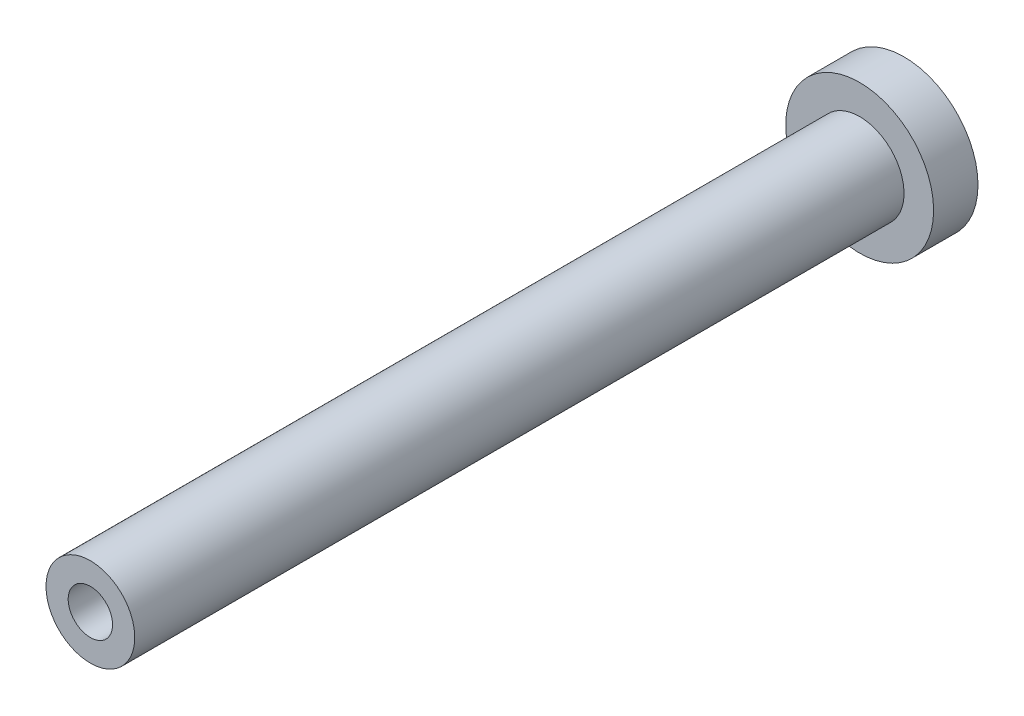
ISO-10303-21;
HEADER;
FILE_DESCRIPTION(('STEP AP214'),'2;1');
FILE_NAME('part.step','',(''),(''),'','','');
FILE_SCHEMA(('AUTOMOTIVE_DESIGN { 1 0 10303 214 1 1 1 1 }'));
ENDSEC;
DATA;
#1=APPLICATION_CONTEXT('core data for automotive mechanical design processes');
#2=APPLICATION_PROTOCOL_DEFINITION('international standard','automotive_design',2000,#1);
#3=PRODUCT_CONTEXT('',#1,'mechanical');
#4=PRODUCT('Part','Part','',(#3));
#5=PRODUCT_RELATED_PRODUCT_CATEGORY('part','',(#4));
#6=PRODUCT_DEFINITION_FORMATION('','',#4);
#7=PRODUCT_DEFINITION_CONTEXT('part definition',#1,'design');
#8=PRODUCT_DEFINITION('design','',#6,#7);
#9=PRODUCT_DEFINITION_SHAPE('','',#8);
#10=(LENGTH_UNIT() NAMED_UNIT(*) SI_UNIT(.MILLI.,.METRE.));
#11=(NAMED_UNIT(*) PLANE_ANGLE_UNIT() SI_UNIT($,.RADIAN.));
#12=(NAMED_UNIT(*) SI_UNIT($,.STERADIAN.) SOLID_ANGLE_UNIT());
#13=UNCERTAINTY_MEASURE_WITH_UNIT(LENGTH_MEASURE(1.E-05),#10,'distance_accuracy_value','');
#14=(GEOMETRIC_REPRESENTATION_CONTEXT(3) GLOBAL_UNCERTAINTY_ASSIGNED_CONTEXT((#13)) GLOBAL_UNIT_ASSIGNED_CONTEXT((#10,
#11,#12)) REPRESENTATION_CONTEXT('',''));
#15=CARTESIAN_POINT('',(0.,0.,0.));
#16=DIRECTION('',(0.,0.,1.));
#17=DIRECTION('',(1.,0.,0.));
#18=AXIS2_PLACEMENT_3D('',#15,#16,#17);
#19=CARTESIAN_POINT('',(0.,0.,3.));
#20=DIRECTION('',(0.,0.,1.));
#21=DIRECTION('',(1.,0.,0.));
#22=AXIS2_PLACEMENT_3D('',#19,#20,#21);
#23=PLANE('',#22);
#24=CARTESIAN_POINT('',(0.,0.,3.));
#25=DIRECTION('',(0.,0.,1.));
#26=DIRECTION('',(1.,0.,0.));
#27=AXIS2_PLACEMENT_3D('',#24,#25,#26);
#28=CIRCLE('',#27,5.);
#29=CARTESIAN_POINT('',(5.,0.,3.));
#30=VERTEX_POINT('',#29);
#31=EDGE_CURVE('E10',#30,#30,#28,.T.);
#32=ORIENTED_EDGE('',*,*,#31,.T.);
#33=EDGE_LOOP('',(#32));
#34=FACE_BOUND('',#33,.T.);
#35=CARTESIAN_POINT('',(0.,0.,3.));
#36=DIRECTION('',(0.,0.,1.));
#37=DIRECTION('',(1.,0.,0.));
#38=AXIS2_PLACEMENT_3D('',#35,#36,#37);
#39=CIRCLE('',#38,3.);
#40=CARTESIAN_POINT('',(-3.,0.,3.));
#41=VERTEX_POINT('',#40);
#42=EDGE_CURVE('E43',#41,#41,#39,.T.);
#43=ORIENTED_EDGE('',*,*,#42,.F.);
#44=EDGE_LOOP('',(#43));
#45=FACE_BOUND('',#44,.T.);
#46=ADVANCED_FACE('F30',(#34,#45),#23,.T.);
#47=CARTESIAN_POINT('',(0.,0.,3.));
#48=DIRECTION('',(0.,0.,-1.));
#49=DIRECTION('',(-1.,0.,0.));
#50=AXIS2_PLACEMENT_3D('',#47,#48,#49);
#51=CYLINDRICAL_SURFACE('',#50,5.);
#52=ORIENTED_EDGE('',*,*,#31,.F.);
#53=EDGE_LOOP('',(#52));
#54=FACE_BOUND('',#53,.T.);
#55=CARTESIAN_POINT('',(0.,0.,0.));
#56=DIRECTION('',(0.,0.,1.));
#57=DIRECTION('',(1.,0.,0.));
#58=AXIS2_PLACEMENT_3D('',#55,#56,#57);
#59=CIRCLE('',#58,5.);
#60=CARTESIAN_POINT('',(5.,0.,0.));
#61=VERTEX_POINT('',#60);
#62=EDGE_CURVE('E34',#61,#61,#59,.T.);
#63=ORIENTED_EDGE('',*,*,#62,.T.);
#64=EDGE_LOOP('',(#63));
#65=FACE_BOUND('',#64,.T.);
#66=ADVANCED_FACE('F32',(#54,#65),#51,.T.);
#67=CARTESIAN_POINT('',(0.,0.,0.));
#68=DIRECTION('',(0.,0.,1.));
#69=DIRECTION('',(1.,0.,0.));
#70=AXIS2_PLACEMENT_3D('',#67,#68,#69);
#71=PLANE('',#70);
#72=ORIENTED_EDGE('',*,*,#62,.F.);
#73=EDGE_LOOP('',(#72));
#74=FACE_BOUND('',#73,.T.);
#75=ADVANCED_FACE('F72',(#74),#71,.F.);
#76=CARTESIAN_POINT('',(0.,0.,55.));
#77=DIRECTION('',(0.,0.,-1.));
#78=DIRECTION('',(-1.,0.,0.));
#79=AXIS2_PLACEMENT_3D('',#76,#77,#78);
#80=CYLINDRICAL_SURFACE('',#79,3.);
#81=CARTESIAN_POINT('',(0.,0.,55.));
#82=DIRECTION('',(0.,0.,1.));
#83=DIRECTION('',(1.,0.,0.));
#84=AXIS2_PLACEMENT_3D('',#81,#82,#83);
#85=CIRCLE('',#84,3.);
#86=CARTESIAN_POINT('',(-3.,0.,55.));
#87=VERTEX_POINT('',#86);
#88=EDGE_CURVE('E41',#87,#87,#85,.T.);
#89=CARTESIAN_POINT('',(-3.,0.,55.));
#90=CARTESIAN_POINT('',(-3.,0.,54.4583333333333));
#91=CARTESIAN_POINT('',(-3.,0.,53.9166666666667));
#92=CARTESIAN_POINT('',(-3.,0.,52.8333333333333));
#93=CARTESIAN_POINT('',(-3.,0.,52.2916666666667));
#94=CARTESIAN_POINT('',(-3.,0.,51.2083333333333));
#95=CARTESIAN_POINT('',(-3.,0.,50.6666666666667));
#96=CARTESIAN_POINT('',(-3.,0.,49.5833333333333));
#97=CARTESIAN_POINT('',(-3.,0.,49.0416666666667));
#98=CARTESIAN_POINT('',(-3.,0.,47.9583333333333));
#99=CARTESIAN_POINT('',(-3.,0.,47.4166666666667));
#100=CARTESIAN_POINT('',(-3.,0.,46.3333333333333));
#101=CARTESIAN_POINT('',(-3.,0.,45.7916666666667));
#102=CARTESIAN_POINT('',(-3.,0.,44.7083333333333));
#103=CARTESIAN_POINT('',(-3.,0.,44.1666666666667));
#104=CARTESIAN_POINT('',(-3.,0.,43.0833333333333));
#105=CARTESIAN_POINT('',(-3.,0.,42.5416666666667));
#106=CARTESIAN_POINT('',(-3.,0.,41.4583333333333));
#107=CARTESIAN_POINT('',(-3.,0.,40.9166666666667));
#108=CARTESIAN_POINT('',(-3.,0.,39.8333333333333));
#109=CARTESIAN_POINT('',(-3.,0.,39.2916666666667));
#110=CARTESIAN_POINT('',(-3.,0.,38.2083333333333));
#111=CARTESIAN_POINT('',(-3.,0.,37.6666666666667));
#112=CARTESIAN_POINT('',(-3.,0.,36.5833333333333));
#113=CARTESIAN_POINT('',(-3.,0.,36.0416666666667));
#114=CARTESIAN_POINT('',(-3.,0.,34.9583333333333));
#115=CARTESIAN_POINT('',(-3.,0.,34.4166666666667));
#116=CARTESIAN_POINT('',(-3.,0.,33.3333333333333));
#117=CARTESIAN_POINT('',(-3.,0.,32.7916666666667));
#118=CARTESIAN_POINT('',(-3.,0.,31.7083333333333));
#119=CARTESIAN_POINT('',(-3.,0.,31.1666666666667));
#120=CARTESIAN_POINT('',(-3.,0.,30.0833333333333));
#121=CARTESIAN_POINT('',(-3.,0.,29.5416666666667));
#122=CARTESIAN_POINT('',(-3.,0.,28.4583333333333));
#123=CARTESIAN_POINT('',(-3.,0.,27.9166666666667));
#124=CARTESIAN_POINT('',(-3.,0.,26.8333333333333));
#125=CARTESIAN_POINT('',(-3.,0.,26.2916666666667));
#126=CARTESIAN_POINT('',(-3.,0.,25.2083333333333));
#127=CARTESIAN_POINT('',(-3.,0.,24.6666666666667));
#128=CARTESIAN_POINT('',(-3.,0.,23.5833333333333));
#129=CARTESIAN_POINT('',(-3.,0.,23.0416666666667));
#130=CARTESIAN_POINT('',(-3.,0.,21.9583333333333));
#131=CARTESIAN_POINT('',(-3.,0.,21.4166666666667));
#132=CARTESIAN_POINT('',(-3.,0.,20.3333333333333));
#133=CARTESIAN_POINT('',(-3.,0.,19.7916666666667));
#134=CARTESIAN_POINT('',(-3.,0.,18.7083333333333));
#135=CARTESIAN_POINT('',(-3.,0.,18.1666666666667));
#136=CARTESIAN_POINT('',(-3.,0.,17.0833333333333));
#137=CARTESIAN_POINT('',(-3.,0.,16.5416666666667));
#138=CARTESIAN_POINT('',(-3.,0.,15.4583333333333));
#139=CARTESIAN_POINT('',(-3.,0.,14.9166666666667));
#140=CARTESIAN_POINT('',(-3.,0.,13.8333333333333));
#141=CARTESIAN_POINT('',(-3.,0.,13.2916666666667));
#142=CARTESIAN_POINT('',(-3.,0.,12.2083333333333));
#143=CARTESIAN_POINT('',(-3.,0.,11.6666666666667));
#144=CARTESIAN_POINT('',(-3.,0.,10.5833333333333));
#145=CARTESIAN_POINT('',(-3.,0.,10.0416666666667));
#146=CARTESIAN_POINT('',(-3.,0.,8.95833333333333));
#147=CARTESIAN_POINT('',(-3.,0.,8.41666666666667));
#148=CARTESIAN_POINT('',(-3.,0.,7.33333333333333));
#149=CARTESIAN_POINT('',(-3.,0.,6.79166666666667));
#150=CARTESIAN_POINT('',(-3.,0.,5.70833333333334));
#151=CARTESIAN_POINT('',(-3.,0.,5.16666666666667));
#152=CARTESIAN_POINT('',(-3.,0.,4.08333333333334));
#153=CARTESIAN_POINT('',(-3.,0.,3.54166666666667));
#154=CARTESIAN_POINT('',(-3.,0.,3.));
#155=B_SPLINE_CURVE_WITH_KNOTS('',3,(#89,#90,#91,#92,#93,#94,#95,#96,#97,#98,#99,#100,#101,#102,
#103,#104,#105,#106,#107,#108,#109,#110,#111,#112,#113,#114,#115,#116,#117,#118,#119,#120,#121,
#122,#123,#124,#125,#126,#127,#128,#129,#130,#131,#132,#133,#134,#135,#136,#137,#138,#139,#140,
#141,#142,#143,#144,#145,#146,#147,#148,#149,#150,#151,#152,#153,#154),.UNSPECIFIED.,.F.,.F.,(4,
2,2,2,2,2,2,2,2,2,2,2,2,2,2,2,2,2,2,2,2,2,2,2,2,2,2,2,2,2,2,2,4),(0.,1.625,3.25,4.875,
6.50000000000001,8.125,9.75,11.375,13.,14.625,16.25,17.875,19.5,21.125,22.75,24.375,26.,27.625,
29.25,30.875,32.5,34.125,35.75,37.375,39.,40.625,42.25,43.875,45.5,47.125,48.75,50.375,52.),.UNSPECIFIED.);
#156=EDGE_CURVE('BSEAM66',#87,#41,#155,.T.);
#157=ORIENTED_EDGE('',*,*,#88,.F.);
#158=ORIENTED_EDGE('',*,*,#42,.T.);
#159=ORIENTED_EDGE('',*,*,#156,.T.);
#160=ORIENTED_EDGE('',*,*,#156,.F.);
#161=EDGE_LOOP('',(#157,#159,#158,#160));
#162=FACE_BOUND('',#161,.T.);
#163=ADVANCED_FACE('F66',(#162),#80,.T.);
#164=CARTESIAN_POINT('',(0.,0.,55.));
#165=DIRECTION('',(0.,0.,1.));
#166=DIRECTION('',(1.,0.,0.));
#167=AXIS2_PLACEMENT_3D('',#164,#165,#166);
#168=PLANE('',#167);
#169=CARTESIAN_POINT('',(0.,0.,55.));
#170=DIRECTION('',(0.,0.,1.));
#171=DIRECTION('',(1.,0.,0.));
#172=AXIS2_PLACEMENT_3D('',#169,#170,#171);
#173=CIRCLE('',#172,1.5);
#174=CARTESIAN_POINT('',(1.5,0.,55.));
#175=VERTEX_POINT('',#174);
#176=EDGE_CURVE('E49',#175,#175,#173,.T.);
#177=ORIENTED_EDGE('',*,*,#176,.F.);
#178=EDGE_LOOP('',(#177));
#179=FACE_BOUND('',#178,.T.);
#180=ORIENTED_EDGE('',*,*,#88,.T.);
#181=EDGE_LOOP('',(#180));
#182=FACE_BOUND('',#181,.T.);
#183=ADVANCED_FACE('F60',(#179,#182),#168,.T.);
#184=CARTESIAN_POINT('',(0.,0.,40.));
#185=DIRECTION('',(0.,0.,1.));
#186=DIRECTION('',(1.,0.,0.));
#187=AXIS2_PLACEMENT_3D('',#184,#185,#186);
#188=CYLINDRICAL_SURFACE('',#187,1.5);
#189=CARTESIAN_POINT('',(0.,0.,40.));
#190=DIRECTION('',(0.,0.,1.));
#191=DIRECTION('',(1.,0.,0.));
#192=AXIS2_PLACEMENT_3D('',#189,#190,#191);
#193=CIRCLE('',#192,1.5);
#194=CARTESIAN_POINT('',(1.5,0.,40.));
#195=VERTEX_POINT('',#194);
#196=EDGE_CURVE('E46',#195,#195,#193,.T.);
#197=ORIENTED_EDGE('',*,*,#196,.F.);
#198=EDGE_LOOP('',(#197));
#199=FACE_BOUND('',#198,.T.);
#200=ORIENTED_EDGE('',*,*,#176,.T.);
#201=EDGE_LOOP('',(#200));
#202=FACE_BOUND('',#201,.T.);
#203=ADVANCED_FACE('F57',(#199,#202),#188,.F.);
#204=CARTESIAN_POINT('',(0.,0.,40.));
#205=DIRECTION('',(0.,0.,1.));
#206=DIRECTION('',(1.,0.,0.));
#207=AXIS2_PLACEMENT_3D('',#204,#205,#206);
#208=PLANE('',#207);
#209=ORIENTED_EDGE('',*,*,#196,.T.);
#210=EDGE_LOOP('',(#209));
#211=FACE_BOUND('',#210,.T.);
#212=ADVANCED_FACE('F55',(#211),#208,.T.);
#213=CLOSED_SHELL('',(#46,#66,#75,#163,#183,#203,#212));
#214=MANIFOLD_SOLID_BREP('B2',#213);
#215=ADVANCED_BREP_SHAPE_REPRESENTATION('',(#18,#214),#14);
#216=SHAPE_DEFINITION_REPRESENTATION(#9,#215);
ENDSEC;
END-ISO-10303-21;
